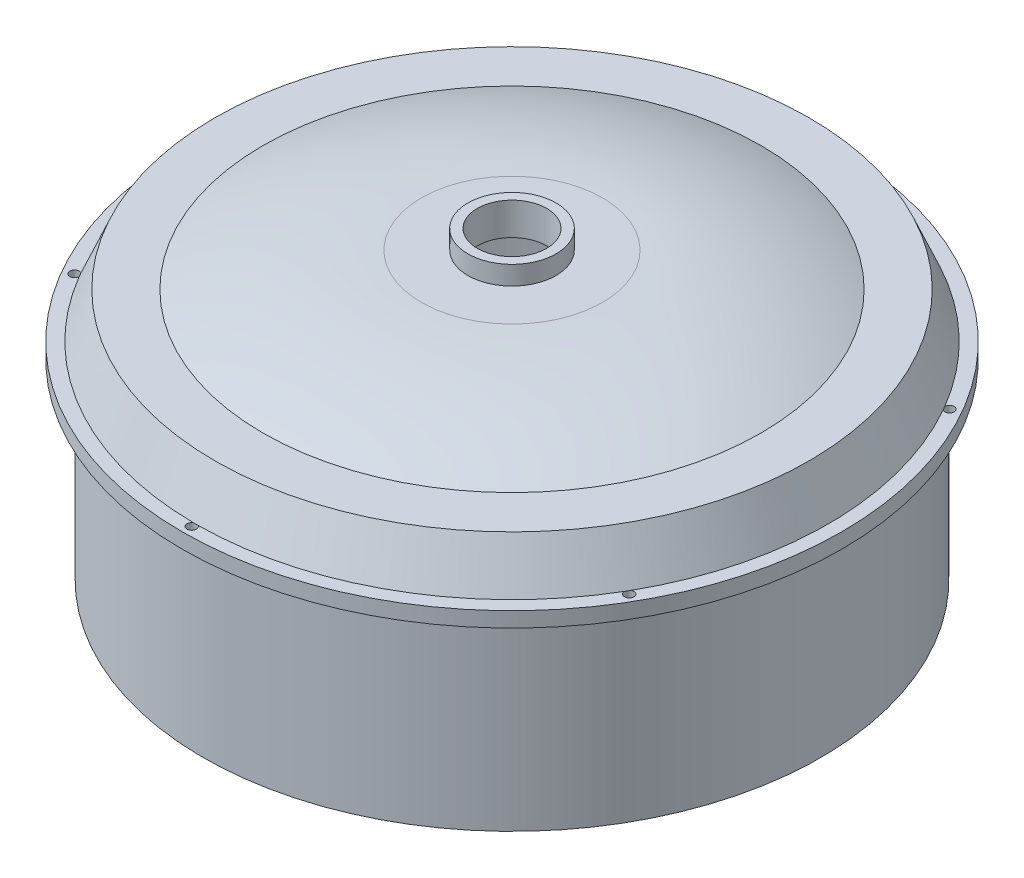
ISO-10303-21;
HEADER;
FILE_DESCRIPTION(('STEP AP214'),'2;1');
FILE_NAME('part.step','',(''),(''),'','','');
FILE_SCHEMA(('AUTOMOTIVE_DESIGN { 1 0 10303 214 1 1 1 1 }'));
ENDSEC;
DATA;
#1=APPLICATION_CONTEXT('core data for automotive mechanical design processes');
#2=APPLICATION_PROTOCOL_DEFINITION('international standard','automotive_design',2000,#1);
#3=PRODUCT_CONTEXT('',#1,'mechanical');
#4=PRODUCT('Part','Part','',(#3));
#5=PRODUCT_RELATED_PRODUCT_CATEGORY('part','',(#4));
#6=PRODUCT_DEFINITION_FORMATION('','',#4);
#7=PRODUCT_DEFINITION_CONTEXT('part definition',#1,'design');
#8=PRODUCT_DEFINITION('design','',#6,#7);
#9=PRODUCT_DEFINITION_SHAPE('','',#8);
#10=(LENGTH_UNIT() NAMED_UNIT(*) SI_UNIT(.MILLI.,.METRE.));
#11=(NAMED_UNIT(*) PLANE_ANGLE_UNIT() SI_UNIT($,.RADIAN.));
#12=(NAMED_UNIT(*) SI_UNIT($,.STERADIAN.) SOLID_ANGLE_UNIT());
#13=UNCERTAINTY_MEASURE_WITH_UNIT(LENGTH_MEASURE(1.E-05),#10,'distance_accuracy_value','');
#14=(GEOMETRIC_REPRESENTATION_CONTEXT(3) GLOBAL_UNCERTAINTY_ASSIGNED_CONTEXT((#13)) GLOBAL_UNIT_ASSIGNED_CONTEXT((#10,
#11,#12)) REPRESENTATION_CONTEXT('',''));
#15=CARTESIAN_POINT('',(0.,0.,0.));
#16=DIRECTION('',(0.,0.,1.));
#17=DIRECTION('',(1.,0.,0.));
#18=AXIS2_PLACEMENT_3D('',#15,#16,#17);
#19=CARTESIAN_POINT('',(0.,-39.7264975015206,0.));
#20=DIRECTION('',(0.,1.,0.));
#21=DIRECTION('',(-1.,0.,0.));
#22=AXIS2_PLACEMENT_3D('',#19,#20,#21);
#23=DEGENERATE_TOROIDAL_SURFACE('',#22,24.0362837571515,98.762425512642,.T.);
#24=CARTESIAN_POINT('',(0.,50.853335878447,0.));
#25=DIRECTION('',(0.,1.,0.));
#26=DIRECTION('',(-1.,0.,0.));
#27=AXIS2_PLACEMENT_3D('',#24,#25,#26);
#28=CIRCLE('',#27,63.3975652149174);
#29=CARTESIAN_POINT('',(-63.3975652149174,50.853335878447,0.));
#30=VERTEX_POINT('',#29);
#31=EDGE_CURVE('E11',#30,#30,#28,.T.);
#32=ORIENTED_EDGE('',*,*,#31,.F.);
#33=EDGE_LOOP('',(#32));
#34=FACE_BOUND('',#33,.T.);
#35=CARTESIAN_POINT('',(0.,59.,0.));
#36=DIRECTION('',(0.,1.,0.));
#37=DIRECTION('',(-1.,0.,0.));
#38=AXIS2_PLACEMENT_3D('',#35,#36,#37);
#39=CIRCLE('',#38,26.7);
#40=CARTESIAN_POINT('',(-26.7,59.,0.));
#41=VERTEX_POINT('',#40);
#42=EDGE_CURVE('E489',#41,#41,#39,.T.);
#43=ORIENTED_EDGE('',*,*,#42,.T.);
#44=EDGE_LOOP('',(#43));
#45=FACE_BOUND('',#44,.T.);
#46=ADVANCED_FACE('F350',(#34,#45),#23,.F.);
#47=CARTESIAN_POINT('',(74.5091676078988,50.853335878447,0.));
#48=DIRECTION('',(0.,1.,0.));
#49=DIRECTION('',(-1.,0.,0.));
#50=AXIS2_PLACEMENT_3D('',#47,#48,#49);
#51=PLANE('',#50);
#52=CARTESIAN_POINT('',(0.,50.8533358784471,0.));
#53=DIRECTION('',(0.,1.,0.));
#54=DIRECTION('',(-1.,0.,0.));
#55=AXIS2_PLACEMENT_3D('',#52,#53,#54);
#56=CIRCLE('',#55,74.5091676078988);
#57=CARTESIAN_POINT('',(-74.5091676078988,50.8533358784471,0.));
#58=VERTEX_POINT('',#57);
#59=EDGE_CURVE('E357',#58,#58,#56,.T.);
#60=ORIENTED_EDGE('',*,*,#59,.F.);
#61=EDGE_LOOP('',(#60));
#62=FACE_BOUND('',#61,.T.);
#63=ORIENTED_EDGE('',*,*,#31,.T.);
#64=EDGE_LOOP('',(#63));
#65=FACE_BOUND('',#64,.T.);
#66=ADVANCED_FACE('F527',(#62,#65),#51,.F.);
#67=CARTESIAN_POINT('',(0.,50.8533358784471,0.));
#68=DIRECTION('',(0.,-1.,0.));
#69=DIRECTION('',(1.,0.,0.));
#70=AXIS2_PLACEMENT_3D('',#67,#68,#69);
#71=CONICAL_SURFACE('',#70,74.5091676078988,0.399043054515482);
#72=CARTESIAN_POINT('',(0.,41.3888888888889,0.));
#73=DIRECTION('',(0.,1.,0.));
#74=DIRECTION('',(-1.,0.,0.));
#75=AXIS2_PLACEMENT_3D('',#72,#73,#74);
#76=CIRCLE('',#75,78.5);
#77=CARTESIAN_POINT('',(-78.5,41.3888888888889,0.));
#78=VERTEX_POINT('',#77);
#79=EDGE_CURVE('E745',#78,#78,#76,.T.);
#80=ORIENTED_EDGE('',*,*,#79,.F.);
#81=EDGE_LOOP('',(#80));
#82=FACE_BOUND('',#81,.T.);
#83=ORIENTED_EDGE('',*,*,#59,.T.);
#84=EDGE_LOOP('',(#83));
#85=FACE_BOUND('',#84,.T.);
#86=ADVANCED_FACE('F532',(#82,#85),#71,.F.);
#87=CARTESIAN_POINT('',(0.,40.,0.));
#88=DIRECTION('',(0.,1.,0.));
#89=DIRECTION('',(-1.,0.,0.));
#90=AXIS2_PLACEMENT_3D('',#87,#88,#89);
#91=CYLINDRICAL_SURFACE('',#90,78.5);
#92=CARTESIAN_POINT('',(0.,-12.6111111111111,0.));
#93=DIRECTION('',(0.,1.,0.));
#94=DIRECTION('',(-1.,0.,0.));
#95=AXIS2_PLACEMENT_3D('',#92,#93,#94);
#96=CIRCLE('',#95,78.5);
#97=CARTESIAN_POINT('',(-78.5,-12.6111111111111,0.));
#98=VERTEX_POINT('',#97);
#99=EDGE_CURVE('E748',#98,#98,#96,.T.);
#100=ORIENTED_EDGE('',*,*,#99,.F.);
#101=EDGE_LOOP('',(#100));
#102=FACE_BOUND('',#101,.T.);
#103=ORIENTED_EDGE('',*,*,#79,.T.);
#104=EDGE_LOOP('',(#103));
#105=FACE_BOUND('',#104,.T.);
#106=ADVANCED_FACE('F719',(#102,#105),#91,.F.);
#107=CARTESIAN_POINT('',(78.5,-12.6111111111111,0.));
#108=DIRECTION('',(0.,1.,0.));
#109=DIRECTION('',(-1.,0.,0.));
#110=AXIS2_PLACEMENT_3D('',#107,#108,#109);
#111=PLANE('',#110);
#112=CARTESIAN_POINT('',(0.,-12.6111111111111,0.));
#113=DIRECTION('',(0.,1.,0.));
#114=DIRECTION('',(-1.,0.,0.));
#115=AXIS2_PLACEMENT_3D('',#112,#113,#114);
#116=CIRCLE('',#115,82.);
#117=CARTESIAN_POINT('',(-82.,-12.6111111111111,0.));
#118=VERTEX_POINT('',#117);
#119=EDGE_CURVE('E753',#118,#118,#116,.T.);
#120=ORIENTED_EDGE('',*,*,#119,.F.);
#121=EDGE_LOOP('',(#120));
#122=FACE_BOUND('',#121,.T.);
#123=ORIENTED_EDGE('',*,*,#99,.T.);
#124=EDGE_LOOP('',(#123));
#125=FACE_BOUND('',#124,.T.);
#126=ADVANCED_FACE('F711',(#122,#125),#111,.F.);
#127=CARTESIAN_POINT('',(0.,40.,0.));
#128=DIRECTION('',(0.,1.,0.));
#129=DIRECTION('',(-1.,0.,0.));
#130=AXIS2_PLACEMENT_3D('',#127,#128,#129);
#131=CYLINDRICAL_SURFACE('',#130,82.);
#132=CARTESIAN_POINT('',(0.,38.,0.));
#133=DIRECTION('',(0.,1.,0.));
#134=DIRECTION('',(-1.,0.,0.));
#135=AXIS2_PLACEMENT_3D('',#132,#133,#134);
#136=CIRCLE('',#135,82.);
#137=CARTESIAN_POINT('',(-82.,38.,0.));
#138=VERTEX_POINT('',#137);
#139=EDGE_CURVE('E756',#138,#138,#136,.T.);
#140=ORIENTED_EDGE('',*,*,#139,.F.);
#141=EDGE_LOOP('',(#140));
#142=FACE_BOUND('',#141,.T.);
#143=ORIENTED_EDGE('',*,*,#119,.T.);
#144=EDGE_LOOP('',(#143));
#145=FACE_BOUND('',#144,.T.);
#146=ADVANCED_FACE('F704',(#142,#145),#131,.T.);
#147=CARTESIAN_POINT('',(82.,38.,0.));
#148=DIRECTION('',(0.,1.,0.));
#149=DIRECTION('',(-1.,0.,0.));
#150=AXIS2_PLACEMENT_3D('',#147,#148,#149);
#151=PLANE('',#150);
#152=CARTESIAN_POINT('',(73.6121593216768,38.,42.5000000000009));
#153=DIRECTION('',(0.,1.,0.));
#154=DIRECTION('',(-0.50000000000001,0.,0.866025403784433));
#155=AXIS2_PLACEMENT_3D('',#152,#153,#154);
#156=CIRCLE('',#155,1.25);
#157=CARTESIAN_POINT('',(72.9871593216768,38.,43.5825317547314));
#158=VERTEX_POINT('',#157);
#159=EDGE_CURVE('E424',#158,#158,#156,.T.);
#160=ORIENTED_EDGE('',*,*,#159,.T.);
#161=EDGE_LOOP('',(#160));
#162=FACE_BOUND('',#161,.T.);
#163=CARTESIAN_POINT('',(73.6121593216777,38.,-42.4999999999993));
#164=DIRECTION('',(0.,1.,0.));
#165=DIRECTION('',(0.499999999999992,0.,0.866025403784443));
#166=AXIS2_PLACEMENT_3D('',#163,#164,#165);
#167=CIRCLE('',#166,1.25);
#168=CARTESIAN_POINT('',(74.2371593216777,38.,-41.4174682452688));
#169=VERTEX_POINT('',#168);
#170=EDGE_CURVE('E415',#169,#169,#167,.T.);
#171=ORIENTED_EDGE('',*,*,#170,.T.);
#172=EDGE_LOOP('',(#171));
#173=FACE_BOUND('',#172,.T.);
#174=CARTESIAN_POINT('',(5.9387062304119E-13,38.,-85.));
#175=DIRECTION('',(0.,1.,0.));
#176=DIRECTION('',(1.,0.,0.));
#177=AXIS2_PLACEMENT_3D('',#174,#175,#176);
#178=CIRCLE('',#177,1.25);
#179=CARTESIAN_POINT('',(1.2500000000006,38.,-85.));
#180=VERTEX_POINT('',#179);
#181=EDGE_CURVE('E464',#180,#180,#178,.T.);
#182=ORIENTED_EDGE('',*,*,#181,.T.);
#183=EDGE_LOOP('',(#182));
#184=FACE_BOUND('',#183,.T.);
#185=CARTESIAN_POINT('',(-73.6121593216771,38.,-42.5000000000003));
#186=DIRECTION('',(0.,1.,0.));
#187=DIRECTION('',(0.500000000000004,0.,-0.866025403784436));
#188=AXIS2_PLACEMENT_3D('',#185,#186,#187);
#189=CIRCLE('',#188,1.25);
#190=CARTESIAN_POINT('',(-72.9871593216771,38.,-43.5825317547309));
#191=VERTEX_POINT('',#190);
#192=EDGE_CURVE('E461',#191,#191,#189,.T.);
#193=ORIENTED_EDGE('',*,*,#192,.T.);
#194=EDGE_LOOP('',(#193));
#195=FACE_BOUND('',#194,.T.);
#196=CARTESIAN_POINT('',(-73.6121593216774,38.,42.4999999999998));
#197=DIRECTION('',(0.,1.,0.));
#198=DIRECTION('',(-0.499999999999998,0.,-0.86602540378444));
#199=AXIS2_PLACEMENT_3D('',#196,#197,#198);
#200=CIRCLE('',#199,1.25);
#201=CARTESIAN_POINT('',(-74.2371593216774,38.,41.4174682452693));
#202=VERTEX_POINT('',#201);
#203=EDGE_CURVE('E475',#202,#202,#200,.T.);
#204=ORIENTED_EDGE('',*,*,#203,.T.);
#205=EDGE_LOOP('',(#204));
#206=FACE_BOUND('',#205,.T.);
#207=CARTESIAN_POINT('',(0.,38.,85.));
#208=DIRECTION('',(0.,1.,0.));
#209=DIRECTION('',(-1.,0.,0.));
#210=AXIS2_PLACEMENT_3D('',#207,#208,#209);
#211=CIRCLE('',#210,1.25);
#212=CARTESIAN_POINT('',(-1.25,38.,85.));
#213=VERTEX_POINT('',#212);
#214=EDGE_CURVE('E486',#213,#213,#211,.T.);
#215=ORIENTED_EDGE('',*,*,#214,.T.);
#216=EDGE_LOOP('',(#215));
#217=FACE_BOUND('',#216,.T.);
#218=CARTESIAN_POINT('',(0.,38.,0.));
#219=DIRECTION('',(0.,1.,0.));
#220=DIRECTION('',(-1.,0.,0.));
#221=AXIS2_PLACEMENT_3D('',#218,#219,#220);
#222=CIRCLE('',#221,87.5);
#223=CARTESIAN_POINT('',(-87.5,38.,0.));
#224=VERTEX_POINT('',#223);
#225=EDGE_CURVE('E759',#224,#224,#222,.T.);
#226=ORIENTED_EDGE('',*,*,#225,.F.);
#227=EDGE_LOOP('',(#226));
#228=FACE_BOUND('',#227,.T.);
#229=ORIENTED_EDGE('',*,*,#139,.T.);
#230=EDGE_LOOP('',(#229));
#231=FACE_BOUND('',#230,.T.);
#232=ADVANCED_FACE('F696',(#162,#173,#184,#195,#206,#217,#228,#231),#151,.F.);
#233=CARTESIAN_POINT('',(0.,40.,0.));
#234=DIRECTION('',(0.,1.,0.));
#235=DIRECTION('',(-1.,0.,0.));
#236=AXIS2_PLACEMENT_3D('',#233,#234,#235);
#237=CYLINDRICAL_SURFACE('',#236,87.5);
#238=CARTESIAN_POINT('',(0.,42.,0.));
#239=DIRECTION('',(0.,1.,0.));
#240=DIRECTION('',(-1.,0.,0.));
#241=AXIS2_PLACEMENT_3D('',#238,#239,#240);
#242=CIRCLE('',#241,87.5);
#243=CARTESIAN_POINT('',(-87.5,42.,0.));
#244=VERTEX_POINT('',#243);
#245=EDGE_CURVE('E429',#244,#244,#242,.T.);
#246=ORIENTED_EDGE('',*,*,#245,.F.);
#247=EDGE_LOOP('',(#246));
#248=FACE_BOUND('',#247,.T.);
#249=ORIENTED_EDGE('',*,*,#225,.T.);
#250=EDGE_LOOP('',(#249));
#251=FACE_BOUND('',#250,.T.);
#252=ADVANCED_FACE('F524',(#248,#251),#237,.T.);
#253=CARTESIAN_POINT('',(87.5,42.,0.));
#254=DIRECTION('',(0.,-1.,0.));
#255=DIRECTION('',(1.,0.,0.));
#256=AXIS2_PLACEMENT_3D('',#253,#254,#255);
#257=PLANE('',#256);
#258=CARTESIAN_POINT('',(0.,42.,0.));
#259=DIRECTION('',(0.,1.,0.));
#260=DIRECTION('',(-1.,0.,0.));
#261=AXIS2_PLACEMENT_3D('',#258,#259,#260);
#262=CIRCLE('',#261,83.9183164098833);
#263=CARTESIAN_POINT('',(72.9846263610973,42.,41.418934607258));
#264=VERTEX_POINT('',#263);
#265=CARTESIAN_POINT('',(72.9846263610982,42.,-41.4189346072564));
#266=VERTEX_POINT('',#265);
#267=EDGE_CURVE('E406',#264,#266,#262,.T.);
#268=ORIENTED_EDGE('',*,*,#267,.F.);
#269=CARTESIAN_POINT('',(73.6121593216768,42.,42.5000000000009));
#270=DIRECTION('',(0.,1.,0.));
#271=DIRECTION('',(-0.50000000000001,0.,0.866025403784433));
#272=AXIS2_PLACEMENT_3D('',#269,#270,#271);
#273=CIRCLE('',#272,1.25);
#274=CARTESIAN_POINT('',(72.3621627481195,42.,42.4970732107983));
#275=VERTEX_POINT('',#274);
#276=EDGE_CURVE('E413',#275,#264,#273,.T.);
#277=ORIENTED_EDGE('',*,*,#276,.F.);
#278=CARTESIAN_POINT('',(0.622463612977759,42.,83.9160078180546));
#279=VERTEX_POINT('',#278);
#280=EDGE_CURVE('E405',#279,#275,#262,.T.);
#281=ORIENTED_EDGE('',*,*,#280,.F.);
#282=CARTESIAN_POINT('',(0.,42.,85.));
#283=DIRECTION('',(0.,1.,0.));
#284=DIRECTION('',(-1.,0.,0.));
#285=AXIS2_PLACEMENT_3D('',#282,#283,#284);
#286=CIRCLE('',#285,1.25);
#287=CARTESIAN_POINT('',(-0.622463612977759,42.,83.9160078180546));
#288=VERTEX_POINT('',#287);
#289=EDGE_CURVE('E482',#288,#279,#286,.T.);
#290=ORIENTED_EDGE('',*,*,#289,.F.);
#291=CARTESIAN_POINT('',(-72.3621627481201,42.,42.4970732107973));
#292=VERTEX_POINT('',#291);
#293=EDGE_CURVE('E434',#292,#288,#262,.T.);
#294=ORIENTED_EDGE('',*,*,#293,.F.);
#295=CARTESIAN_POINT('',(-73.6121593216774,42.,42.4999999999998));
#296=DIRECTION('',(0.,1.,0.));
#297=DIRECTION('',(-0.499999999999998,0.,-0.86602540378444));
#298=AXIS2_PLACEMENT_3D('',#295,#296,#297);
#299=CIRCLE('',#298,1.25);
#300=CARTESIAN_POINT('',(-72.9846263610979,42.,41.418934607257));
#301=VERTEX_POINT('',#300);
#302=EDGE_CURVE('E478',#301,#292,#299,.T.);
#303=ORIENTED_EDGE('',*,*,#302,.F.);
#304=CARTESIAN_POINT('',(-72.9846263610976,42.,-41.4189346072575));
#305=VERTEX_POINT('',#304);
#306=EDGE_CURVE('E433',#305,#301,#262,.T.);
#307=ORIENTED_EDGE('',*,*,#306,.F.);
#308=CARTESIAN_POINT('',(-73.6121593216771,42.,-42.5000000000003));
#309=DIRECTION('',(0.,1.,0.));
#310=DIRECTION('',(0.500000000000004,0.,-0.866025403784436));
#311=AXIS2_PLACEMENT_3D('',#308,#309,#310);
#312=CIRCLE('',#311,1.25);
#313=CARTESIAN_POINT('',(-72.3621627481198,42.,-42.4970732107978));
#314=VERTEX_POINT('',#313);
#315=EDGE_CURVE('E471',#314,#305,#312,.T.);
#316=ORIENTED_EDGE('',*,*,#315,.F.);
#317=CARTESIAN_POINT('',(-0.622463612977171,42.,-83.9160078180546));
#318=VERTEX_POINT('',#317);
#319=EDGE_CURVE('E443',#318,#314,#262,.T.);
#320=ORIENTED_EDGE('',*,*,#319,.F.);
#321=CARTESIAN_POINT('',(5.93904144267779E-13,42.,-85.));
#322=DIRECTION('',(0.,1.,0.));
#323=DIRECTION('',(1.,0.,0.));
#324=AXIS2_PLACEMENT_3D('',#321,#322,#323);
#325=CIRCLE('',#324,1.25);
#326=CARTESIAN_POINT('',(0.622463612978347,42.,-83.9160078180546));
#327=VERTEX_POINT('',#326);
#328=EDGE_CURVE('E460',#327,#318,#325,.T.);
#329=ORIENTED_EDGE('',*,*,#328,.F.);
#330=CARTESIAN_POINT('',(72.3621627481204,42.,-42.4970732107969));
#331=VERTEX_POINT('',#330);
#332=EDGE_CURVE('E408',#331,#327,#262,.T.);
#333=ORIENTED_EDGE('',*,*,#332,.F.);
#334=CARTESIAN_POINT('',(73.6121593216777,42.,-42.4999999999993));
#335=DIRECTION('',(0.,1.,0.));
#336=DIRECTION('',(0.499999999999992,0.,0.866025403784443));
#337=AXIS2_PLACEMENT_3D('',#334,#335,#336);
#338=CIRCLE('',#337,1.25);
#339=EDGE_CURVE('E791',#266,#331,#338,.T.);
#340=ORIENTED_EDGE('',*,*,#339,.F.);
#341=EDGE_LOOP('',(#268,#277,#281,#290,#294,#303,#307,#316,#320,#329,#333,#340));
#342=FACE_BOUND('',#341,.T.);
#343=ORIENTED_EDGE('',*,*,#245,.T.);
#344=EDGE_LOOP('',(#343));
#345=FACE_BOUND('',#344,.T.);
#346=ADVANCED_FACE('F419',(#342,#345),#257,.F.);
#347=CARTESIAN_POINT('',(0.,42.,0.));
#348=DIRECTION('',(0.,-1.,0.));
#349=DIRECTION('',(1.,0.,0.));
#350=AXIS2_PLACEMENT_3D('',#347,#348,#349);
#351=CONICAL_SURFACE('',#350,83.9183164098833,0.399043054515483);
#352=CARTESIAN_POINT('',(0.,54.,0.));
#353=DIRECTION('',(0.,1.,0.));
#354=DIRECTION('',(-1.,0.,0.));
#355=AXIS2_PLACEMENT_3D('',#352,#353,#354);
#356=CIRCLE('',#355,78.858328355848);
#357=CARTESIAN_POINT('',(-78.858328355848,54.,0.));
#358=VERTEX_POINT('',#357);
#359=EDGE_CURVE('E438',#358,#358,#356,.T.);
#360=ORIENTED_EDGE('',*,*,#359,.F.);
#361=EDGE_LOOP('',(#360));
#362=FACE_BOUND('',#361,.T.);
#363=EDGE_CURVE('E427',#288,#279,#262,.T.);
#364=ORIENTED_EDGE('',*,*,#363,.T.);
#365=ORIENTED_EDGE('',*,*,#280,.T.);
#366=EDGE_CURVE('E401',#275,#264,#262,.T.);
#367=ORIENTED_EDGE('',*,*,#366,.T.);
#368=ORIENTED_EDGE('',*,*,#267,.T.);
#369=EDGE_CURVE('E445',#266,#331,#262,.T.);
#370=ORIENTED_EDGE('',*,*,#369,.T.);
#371=ORIENTED_EDGE('',*,*,#332,.T.);
#372=EDGE_CURVE('E437',#327,#318,#262,.T.);
#373=ORIENTED_EDGE('',*,*,#372,.T.);
#374=ORIENTED_EDGE('',*,*,#319,.T.);
#375=EDGE_CURVE('E436',#314,#305,#262,.T.);
#376=ORIENTED_EDGE('',*,*,#375,.T.);
#377=ORIENTED_EDGE('',*,*,#306,.T.);
#378=EDGE_CURVE('E428',#301,#292,#262,.T.);
#379=ORIENTED_EDGE('',*,*,#378,.T.);
#380=ORIENTED_EDGE('',*,*,#293,.T.);
#381=EDGE_LOOP('',(#364,#365,#367,#368,#370,#371,#373,#374,#376,#377,#379,#380));
#382=FACE_BOUND('',#381,.T.);
#383=ADVANCED_FACE('F425',(#362,#382),#351,.T.);
#384=CARTESIAN_POINT('',(78.858328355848,54.,0.));
#385=DIRECTION('',(0.,-1.,0.));
#386=DIRECTION('',(1.,0.,0.));
#387=AXIS2_PLACEMENT_3D('',#384,#385,#386);
#388=PLANE('',#387);
#389=CARTESIAN_POINT('',(0.,54.,0.));
#390=DIRECTION('',(0.,1.,0.));
#391=DIRECTION('',(-1.,0.,0.));
#392=AXIS2_PLACEMENT_3D('',#389,#390,#391);
#393=CIRCLE('',#392,66.0847909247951);
#394=CARTESIAN_POINT('',(-66.0847909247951,54.,0.));
#395=VERTEX_POINT('',#394);
#396=EDGE_CURVE('E441',#395,#395,#393,.T.);
#397=ORIENTED_EDGE('',*,*,#396,.F.);
#398=EDGE_LOOP('',(#397));
#399=FACE_BOUND('',#398,.T.);
#400=ORIENTED_EDGE('',*,*,#359,.T.);
#401=EDGE_LOOP('',(#400));
#402=FACE_BOUND('',#401,.T.);
#403=ADVANCED_FACE('F512',(#399,#402),#388,.F.);
#404=CARTESIAN_POINT('',(0.,-39.7264975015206,0.));
#405=DIRECTION('',(0.,1.,0.));
#406=DIRECTION('',(-1.,0.,0.));
#407=AXIS2_PLACEMENT_3D('',#404,#405,#406);
#408=DEGENERATE_TOROIDAL_SURFACE('',#407,24.0362837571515,102.726497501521,.T.);
#409=CARTESIAN_POINT('',(0.,63.,0.));
#410=DIRECTION('',(0.,1.,0.));
#411=DIRECTION('',(-1.,0.,0.));
#412=AXIS2_PLACEMENT_3D('',#409,#410,#411);
#413=CIRCLE('',#412,24.0362837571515);
#414=CARTESIAN_POINT('',(-24.0362837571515,63.,0.));
#415=VERTEX_POINT('',#414);
#416=EDGE_CURVE('E504',#415,#415,#413,.T.);
#417=ORIENTED_EDGE('',*,*,#416,.F.);
#418=EDGE_LOOP('',(#417));
#419=FACE_BOUND('',#418,.T.);
#420=ORIENTED_EDGE('',*,*,#396,.T.);
#421=EDGE_LOOP('',(#420));
#422=FACE_BOUND('',#421,.T.);
#423=ADVANCED_FACE('F510',(#419,#422),#408,.T.);
#424=CARTESIAN_POINT('',(24.0362837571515,63.,0.));
#425=DIRECTION('',(0.,-1.,0.));
#426=DIRECTION('',(1.,0.,0.));
#427=AXIS2_PLACEMENT_3D('',#424,#425,#426);
#428=PLANE('',#427);
#429=CARTESIAN_POINT('',(0.,63.,0.));
#430=DIRECTION('',(0.,1.,0.));
#431=DIRECTION('',(-1.,0.,0.));
#432=AXIS2_PLACEMENT_3D('',#429,#430,#431);
#433=CIRCLE('',#432,11.6999999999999);
#434=CARTESIAN_POINT('',(-11.6999999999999,63.,0.));
#435=VERTEX_POINT('',#434);
#436=EDGE_CURVE('E501',#435,#435,#433,.T.);
#437=ORIENTED_EDGE('',*,*,#436,.F.);
#438=EDGE_LOOP('',(#437));
#439=FACE_BOUND('',#438,.T.);
#440=ORIENTED_EDGE('',*,*,#416,.T.);
#441=EDGE_LOOP('',(#440));
#442=FACE_BOUND('',#441,.T.);
#443=ADVANCED_FACE('F560',(#439,#442),#428,.F.);
#444=CARTESIAN_POINT('',(0.,40.,0.));
#445=DIRECTION('',(0.,1.,0.));
#446=DIRECTION('',(-1.,0.,0.));
#447=AXIS2_PLACEMENT_3D('',#444,#445,#446);
#448=CYLINDRICAL_SURFACE('',#447,11.6999999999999);
#449=CARTESIAN_POINT('',(0.,68.,0.));
#450=DIRECTION('',(0.,1.,0.));
#451=DIRECTION('',(-1.,0.,0.));
#452=AXIS2_PLACEMENT_3D('',#449,#450,#451);
#453=CIRCLE('',#452,11.6999999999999);
#454=CARTESIAN_POINT('',(-11.6999999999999,68.,0.));
#455=VERTEX_POINT('',#454);
#456=EDGE_CURVE('E498',#455,#455,#453,.T.);
#457=ORIENTED_EDGE('',*,*,#456,.F.);
#458=EDGE_LOOP('',(#457));
#459=FACE_BOUND('',#458,.T.);
#460=ORIENTED_EDGE('',*,*,#436,.T.);
#461=EDGE_LOOP('',(#460));
#462=FACE_BOUND('',#461,.T.);
#463=ADVANCED_FACE('F554',(#459,#462),#448,.T.);
#464=CARTESIAN_POINT('',(11.6999999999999,68.,0.));
#465=DIRECTION('',(0.,-1.,0.));
#466=DIRECTION('',(1.,0.,0.));
#467=AXIS2_PLACEMENT_3D('',#464,#465,#466);
#468=PLANE('',#467);
#469=CARTESIAN_POINT('',(0.,68.,0.));
#470=DIRECTION('',(0.,1.,0.));
#471=DIRECTION('',(-1.,0.,0.));
#472=AXIS2_PLACEMENT_3D('',#469,#470,#471);
#473=CIRCLE('',#472,9.19999999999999);
#474=CARTESIAN_POINT('',(-9.19999999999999,68.,0.));
#475=VERTEX_POINT('',#474);
#476=EDGE_CURVE('E495',#475,#475,#473,.T.);
#477=ORIENTED_EDGE('',*,*,#476,.F.);
#478=EDGE_LOOP('',(#477));
#479=FACE_BOUND('',#478,.T.);
#480=ORIENTED_EDGE('',*,*,#456,.T.);
#481=EDGE_LOOP('',(#480));
#482=FACE_BOUND('',#481,.T.);
#483=ADVANCED_FACE('F548',(#479,#482),#468,.F.);
#484=CARTESIAN_POINT('',(0.,40.,0.));
#485=DIRECTION('',(0.,1.,0.));
#486=DIRECTION('',(-1.,0.,0.));
#487=AXIS2_PLACEMENT_3D('',#484,#485,#486);
#488=CYLINDRICAL_SURFACE('',#487,9.19999999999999);
#489=CARTESIAN_POINT('',(0.,59.3888888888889,0.));
#490=DIRECTION('',(0.,1.,0.));
#491=DIRECTION('',(-1.,0.,0.));
#492=AXIS2_PLACEMENT_3D('',#489,#490,#491);
#493=CIRCLE('',#492,9.19999999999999);
#494=CARTESIAN_POINT('',(-9.19999999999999,59.3888888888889,0.));
#495=VERTEX_POINT('',#494);
#496=EDGE_CURVE('E492',#495,#495,#493,.T.);
#497=ORIENTED_EDGE('',*,*,#496,.F.);
#498=EDGE_LOOP('',(#497));
#499=FACE_BOUND('',#498,.T.);
#500=ORIENTED_EDGE('',*,*,#476,.T.);
#501=EDGE_LOOP('',(#500));
#502=FACE_BOUND('',#501,.T.);
#503=ADVANCED_FACE('F542',(#499,#502),#488,.F.);
#504=CARTESIAN_POINT('',(0.,59.3888888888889,0.));
#505=DIRECTION('',(0.,-1.,0.));
#506=DIRECTION('',(1.,0.,0.));
#507=AXIS2_PLACEMENT_3D('',#504,#505,#506);
#508=CONICAL_SURFACE('',#507,9.19999999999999,1.54857776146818);
#509=ORIENTED_EDGE('',*,*,#42,.F.);
#510=EDGE_LOOP('',(#509));
#511=FACE_BOUND('',#510,.T.);
#512=ORIENTED_EDGE('',*,*,#496,.T.);
#513=EDGE_LOOP('',(#512));
#514=FACE_BOUND('',#513,.T.);
#515=ADVANCED_FACE('F538',(#511,#514),#508,.F.);
#516=CARTESIAN_POINT('',(0.,-12.6111111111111,85.));
#517=DIRECTION('',(0.,1.,0.));
#518=DIRECTION('',(-1.,0.,0.));
#519=AXIS2_PLACEMENT_3D('',#516,#517,#518);
#520=CYLINDRICAL_SURFACE('',#519,1.25);
#521=EDGE_CURVE('E483',#279,#288,#286,.T.);
#522=ORIENTED_EDGE('',*,*,#521,.T.);
#523=ORIENTED_EDGE('',*,*,#289,.T.);
#524=EDGE_LOOP('',(#522,#523));
#525=FACE_BOUND('',#524,.T.);
#526=ORIENTED_EDGE('',*,*,#214,.F.);
#527=EDGE_LOOP('',(#526));
#528=FACE_BOUND('',#527,.T.);
#529=ADVANCED_FACE('F541',(#525,#528),#520,.F.);
#530=CARTESIAN_POINT('',(0.,42.,85.));
#531=DIRECTION('',(0.,1.,0.));
#532=DIRECTION('',(-1.,0.,0.));
#533=AXIS2_PLACEMENT_3D('',#530,#531,#532);
#534=PLANE('',#533);
#535=ORIENTED_EDGE('',*,*,#521,.F.);
#536=ORIENTED_EDGE('',*,*,#363,.F.);
#537=EDGE_LOOP('',(#535,#536));
#538=FACE_BOUND('',#537,.T.);
#539=ADVANCED_FACE('F576',(#538),#534,.F.);
#540=CARTESIAN_POINT('',(-73.6121593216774,42.,42.4999999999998));
#541=DIRECTION('',(0.,1.,0.));
#542=DIRECTION('',(-0.499999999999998,0.,-0.86602540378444));
#543=AXIS2_PLACEMENT_3D('',#540,#541,#542);
#544=PLANE('',#543);
#545=EDGE_CURVE('E479',#292,#301,#299,.T.);
#546=ORIENTED_EDGE('',*,*,#545,.F.);
#547=ORIENTED_EDGE('',*,*,#378,.F.);
#548=EDGE_LOOP('',(#546,#547));
#549=FACE_BOUND('',#548,.T.);
#550=ADVANCED_FACE('F580',(#549),#544,.F.);
#551=CARTESIAN_POINT('',(-73.6121593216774,-12.6111111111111,42.4999999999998));
#552=DIRECTION('',(0.,1.,0.));
#553=DIRECTION('',(-0.499999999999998,0.,-0.86602540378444));
#554=AXIS2_PLACEMENT_3D('',#551,#552,#553);
#555=CYLINDRICAL_SURFACE('',#554,1.25);
#556=ORIENTED_EDGE('',*,*,#545,.T.);
#557=ORIENTED_EDGE('',*,*,#302,.T.);
#558=EDGE_LOOP('',(#556,#557));
#559=FACE_BOUND('',#558,.T.);
#560=ORIENTED_EDGE('',*,*,#203,.F.);
#561=EDGE_LOOP('',(#560));
#562=FACE_BOUND('',#561,.T.);
#563=ADVANCED_FACE('F582',(#559,#562),#555,.F.);
#564=CARTESIAN_POINT('',(-73.6121593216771,42.,-42.5000000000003));
#565=DIRECTION('',(0.,1.,0.));
#566=DIRECTION('',(0.500000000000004,0.,-0.866025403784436));
#567=AXIS2_PLACEMENT_3D('',#564,#565,#566);
#568=PLANE('',#567);
#569=EDGE_CURVE('E472',#305,#314,#312,.T.);
#570=ORIENTED_EDGE('',*,*,#569,.F.);
#571=ORIENTED_EDGE('',*,*,#375,.F.);
#572=EDGE_LOOP('',(#570,#571));
#573=FACE_BOUND('',#572,.T.);
#574=ADVANCED_FACE('F585',(#573),#568,.F.);
#575=CARTESIAN_POINT('',(-73.6121593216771,-12.6111111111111,-42.5000000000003));
#576=DIRECTION('',(0.,1.,0.));
#577=DIRECTION('',(0.500000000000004,0.,-0.866025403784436));
#578=AXIS2_PLACEMENT_3D('',#575,#576,#577);
#579=CYLINDRICAL_SURFACE('',#578,1.25);
#580=ORIENTED_EDGE('',*,*,#569,.T.);
#581=ORIENTED_EDGE('',*,*,#315,.T.);
#582=EDGE_LOOP('',(#580,#581));
#583=FACE_BOUND('',#582,.T.);
#584=ORIENTED_EDGE('',*,*,#192,.F.);
#585=EDGE_LOOP('',(#584));
#586=FACE_BOUND('',#585,.T.);
#587=ADVANCED_FACE('F589',(#583,#586),#579,.F.);
#588=CARTESIAN_POINT('',(5.93904144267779E-13,42.,-85.));
#589=DIRECTION('',(0.,1.,0.));
#590=DIRECTION('',(1.,0.,0.));
#591=AXIS2_PLACEMENT_3D('',#588,#589,#590);
#592=PLANE('',#591);
#593=EDGE_CURVE('E455',#318,#327,#325,.T.);
#594=ORIENTED_EDGE('',*,*,#593,.F.);
#595=ORIENTED_EDGE('',*,*,#372,.F.);
#596=EDGE_LOOP('',(#594,#595));
#597=FACE_BOUND('',#596,.T.);
#598=ADVANCED_FACE('F454',(#597),#592,.F.);
#599=CARTESIAN_POINT('',(5.93446486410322E-13,-12.6111111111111,-85.));
#600=DIRECTION('',(0.,1.,0.));
#601=DIRECTION('',(1.,0.,0.));
#602=AXIS2_PLACEMENT_3D('',#599,#600,#601);
#603=CYLINDRICAL_SURFACE('',#602,1.25);
#604=ORIENTED_EDGE('',*,*,#593,.T.);
#605=ORIENTED_EDGE('',*,*,#328,.T.);
#606=EDGE_LOOP('',(#604,#605));
#607=FACE_BOUND('',#606,.T.);
#608=ORIENTED_EDGE('',*,*,#181,.F.);
#609=EDGE_LOOP('',(#608));
#610=FACE_BOUND('',#609,.T.);
#611=ADVANCED_FACE('F458',(#607,#610),#603,.F.);
#612=CARTESIAN_POINT('',(73.6121593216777,42.,-42.4999999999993));
#613=DIRECTION('',(0.,1.,0.));
#614=DIRECTION('',(0.499999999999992,0.,0.866025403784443));
#615=AXIS2_PLACEMENT_3D('',#612,#613,#614);
#616=PLANE('',#615);
#617=EDGE_CURVE('E370',#331,#266,#338,.T.);
#618=ORIENTED_EDGE('',*,*,#617,.F.);
#619=ORIENTED_EDGE('',*,*,#369,.F.);
#620=EDGE_LOOP('',(#618,#619));
#621=FACE_BOUND('',#620,.T.);
#622=ADVANCED_FACE('F598',(#621),#616,.F.);
#623=CARTESIAN_POINT('',(73.6121593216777,-12.6111111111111,-42.4999999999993));
#624=DIRECTION('',(0.,1.,0.));
#625=DIRECTION('',(0.499999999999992,0.,0.866025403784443));
#626=AXIS2_PLACEMENT_3D('',#623,#624,#625);
#627=CYLINDRICAL_SURFACE('',#626,1.25);
#628=ORIENTED_EDGE('',*,*,#617,.T.);
#629=ORIENTED_EDGE('',*,*,#339,.T.);
#630=EDGE_LOOP('',(#628,#629));
#631=FACE_BOUND('',#630,.T.);
#632=ORIENTED_EDGE('',*,*,#170,.F.);
#633=EDGE_LOOP('',(#632));
#634=FACE_BOUND('',#633,.T.);
#635=ADVANCED_FACE('F601',(#631,#634),#627,.F.);
#636=CARTESIAN_POINT('',(73.6121593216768,42.,42.5000000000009));
#637=DIRECTION('',(0.,1.,0.));
#638=DIRECTION('',(-0.50000000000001,0.,0.866025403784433));
#639=AXIS2_PLACEMENT_3D('',#636,#637,#638);
#640=PLANE('',#639);
#641=EDGE_CURVE('E363',#264,#275,#273,.T.);
#642=ORIENTED_EDGE('',*,*,#641,.F.);
#643=ORIENTED_EDGE('',*,*,#366,.F.);
#644=EDGE_LOOP('',(#642,#643));
#645=FACE_BOUND('',#644,.T.);
#646=ADVANCED_FACE('F402',(#645),#640,.F.);
#647=CARTESIAN_POINT('',(73.6121593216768,-12.6111111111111,42.5000000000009));
#648=DIRECTION('',(0.,1.,0.));
#649=DIRECTION('',(-0.50000000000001,0.,0.866025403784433));
#650=AXIS2_PLACEMENT_3D('',#647,#648,#649);
#651=CYLINDRICAL_SURFACE('',#650,1.25);
#652=ORIENTED_EDGE('',*,*,#641,.T.);
#653=ORIENTED_EDGE('',*,*,#276,.T.);
#654=EDGE_LOOP('',(#652,#653));
#655=FACE_BOUND('',#654,.T.);
#656=ORIENTED_EDGE('',*,*,#159,.F.);
#657=EDGE_LOOP('',(#656));
#658=FACE_BOUND('',#657,.T.);
#659=ADVANCED_FACE('F411',(#655,#658),#651,.F.);
#660=CLOSED_SHELL('',(#46,#66,#86,#106,#126,#146,#232,#252,#346,#383,#403,#423,#443,#463,#483,
#503,#515,#529,#539,#550,#563,#574,#587,#598,#611,#622,#635,#646,#659));
#661=MANIFOLD_SOLID_BREP('B2',#660);
#662=ADVANCED_BREP_SHAPE_REPRESENTATION('',(#18,#661),#14);
#663=SHAPE_DEFINITION_REPRESENTATION(#9,#662);
ENDSEC;
END-ISO-10303-21;
